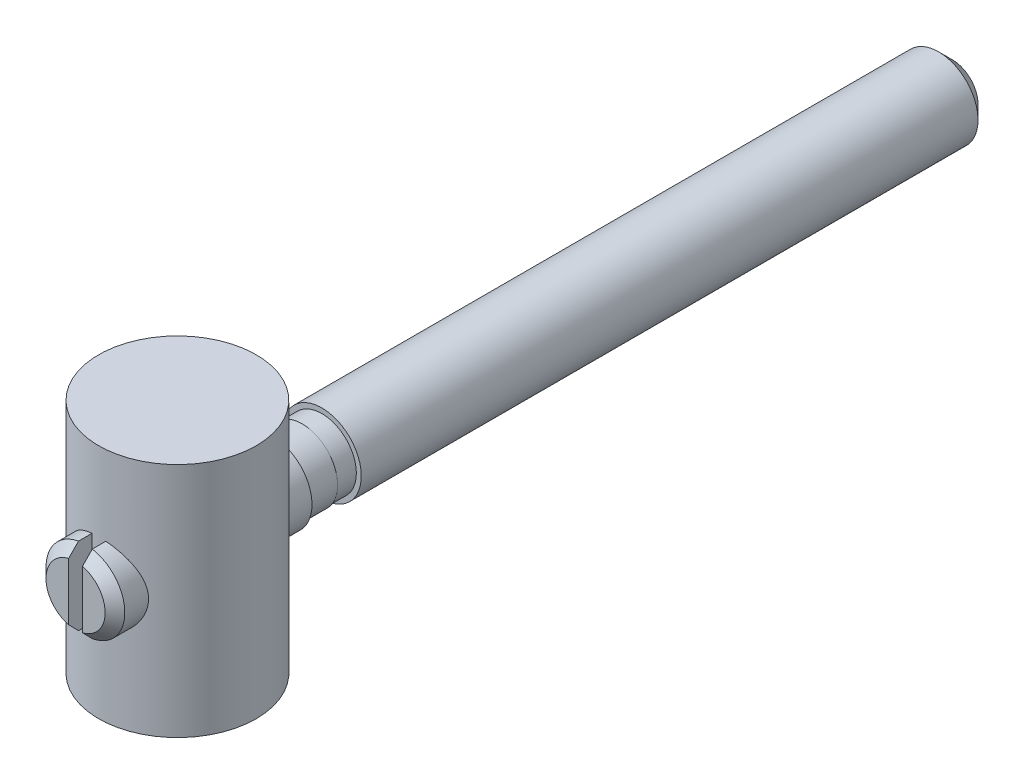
ISO-10303-21;
HEADER;
FILE_DESCRIPTION(('STEP AP214'),'2;1');
FILE_NAME('part.step','',(''),(''),'','','');
FILE_SCHEMA(('AUTOMOTIVE_DESIGN { 1 0 10303 214 1 1 1 1 }'));
ENDSEC;
DATA;
#1=APPLICATION_CONTEXT('core data for automotive mechanical design processes');
#2=APPLICATION_PROTOCOL_DEFINITION('international standard','automotive_design',2000,#1);
#3=PRODUCT_CONTEXT('',#1,'mechanical');
#4=PRODUCT('Part','Part','',(#3));
#5=PRODUCT_RELATED_PRODUCT_CATEGORY('part','',(#4));
#6=PRODUCT_DEFINITION_FORMATION('','',#4);
#7=PRODUCT_DEFINITION_CONTEXT('part definition',#1,'design');
#8=PRODUCT_DEFINITION('design','',#6,#7);
#9=PRODUCT_DEFINITION_SHAPE('','',#8);
#10=(LENGTH_UNIT() NAMED_UNIT(*) SI_UNIT(.MILLI.,.METRE.));
#11=(NAMED_UNIT(*) PLANE_ANGLE_UNIT() SI_UNIT($,.RADIAN.));
#12=(NAMED_UNIT(*) SI_UNIT($,.STERADIAN.) SOLID_ANGLE_UNIT());
#13=UNCERTAINTY_MEASURE_WITH_UNIT(LENGTH_MEASURE(1.E-05),#10,'distance_accuracy_value','');
#14=(GEOMETRIC_REPRESENTATION_CONTEXT(3) GLOBAL_UNCERTAINTY_ASSIGNED_CONTEXT((#13)) GLOBAL_UNIT_ASSIGNED_CONTEXT((#10,
#11,#12)) REPRESENTATION_CONTEXT('',''));
#15=CARTESIAN_POINT('',(0.,0.,0.));
#16=DIRECTION('',(0.,0.,1.));
#17=DIRECTION('',(1.,0.,0.));
#18=AXIS2_PLACEMENT_3D('',#15,#16,#17);
#19=CARTESIAN_POINT('',(0.,-6.,0.));
#20=DIRECTION('',(0.,-1.,0.));
#21=DIRECTION('',(1.,0.,0.));
#22=AXIS2_PLACEMENT_3D('',#19,#20,#21);
#23=PLANE('',#22);
#24=DIRECTION('',(0.5,0.,-0.866025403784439));
#25=VECTOR('',#24,1.);
#26=CARTESIAN_POINT('',(0.86602540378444,-6.,0.));
#27=LINE('',#26,#25);
#28=CARTESIAN_POINT('',(0.433012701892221,-6.,0.75));
#29=VERTEX_POINT('',#28);
#30=CARTESIAN_POINT('',(0.86602540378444,-6.,0.));
#31=VERTEX_POINT('',#30);
#32=EDGE_CURVE('E94',#29,#31,#27,.T.);
#33=ORIENTED_EDGE('',*,*,#32,.F.);
#34=DIRECTION('',(1.,0.,0.));
#35=VECTOR('',#34,1.);
#36=CARTESIAN_POINT('',(0.43301270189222,-6.,0.75));
#37=LINE('',#36,#35);
#38=CARTESIAN_POINT('',(-0.433012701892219,-6.,0.75));
#39=VERTEX_POINT('',#38);
#40=EDGE_CURVE('E92',#39,#29,#37,.T.);
#41=ORIENTED_EDGE('',*,*,#40,.F.);
#42=DIRECTION('',(0.5,0.,0.866025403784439));
#43=VECTOR('',#42,1.);
#44=CARTESIAN_POINT('',(-0.433012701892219,-6.,0.75));
#45=LINE('',#44,#43);
#46=CARTESIAN_POINT('',(-0.866025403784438,-6.,0.));
#47=VERTEX_POINT('',#46);
#48=EDGE_CURVE('E524',#47,#39,#45,.T.);
#49=ORIENTED_EDGE('',*,*,#48,.F.);
#50=DIRECTION('',(-0.5,0.,0.866025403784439));
#51=VECTOR('',#50,1.);
#52=CARTESIAN_POINT('',(-0.866025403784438,-6.,0.));
#53=LINE('',#52,#51);
#54=CARTESIAN_POINT('',(-0.433012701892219,-6.,-0.75));
#55=VERTEX_POINT('',#54);
#56=EDGE_CURVE('E574',#55,#47,#53,.T.);
#57=ORIENTED_EDGE('',*,*,#56,.F.);
#58=DIRECTION('',(-1.,0.,0.));
#59=VECTOR('',#58,1.);
#60=CARTESIAN_POINT('',(-0.433012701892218,-6.,-0.75));
#61=LINE('',#60,#59);
#62=CARTESIAN_POINT('',(0.433012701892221,-6.,-0.75));
#63=VERTEX_POINT('',#62);
#64=EDGE_CURVE('E535',#63,#55,#61,.T.);
#65=ORIENTED_EDGE('',*,*,#64,.F.);
#66=DIRECTION('',(-0.5,0.,-0.866025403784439));
#67=VECTOR('',#66,1.);
#68=CARTESIAN_POINT('',(0.433012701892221,-6.,-0.75));
#69=LINE('',#68,#67);
#70=EDGE_CURVE('E522',#31,#63,#69,.T.);
#71=ORIENTED_EDGE('',*,*,#70,.F.);
#72=EDGE_LOOP('',(#33,#41,#49,#57,#65,#71));
#73=FACE_BOUND('',#72,.T.);
#74=ADVANCED_FACE('F14',(#73),#23,.T.);
#75=CARTESIAN_POINT('',(0.433012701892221,-5.8,-0.75));
#76=DIRECTION('',(0.866025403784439,0.,-0.5));
#77=DIRECTION('',(-0.5,0.,-0.866025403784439));
#78=AXIS2_PLACEMENT_3D('',#75,#76,#77);
#79=PLANE('',#78);
#80=DIRECTION('',(0.,1.,0.));
#81=VECTOR('',#80,1.);
#82=CARTESIAN_POINT('',(0.86602540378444,-5.8,0.));
#83=LINE('',#82,#81);
#84=CARTESIAN_POINT('',(0.86602540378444,-7.,0.));
#85=VERTEX_POINT('',#84);
#86=EDGE_CURVE('E80',#31,#85,#83,.F.);
#87=ORIENTED_EDGE('',*,*,#86,.F.);
#88=ORIENTED_EDGE('',*,*,#70,.T.);
#89=DIRECTION('',(0.,1.,0.));
#90=VECTOR('',#89,1.);
#91=CARTESIAN_POINT('',(0.433012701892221,-5.8,-0.75));
#92=LINE('',#91,#90);
#93=CARTESIAN_POINT('',(0.433012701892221,-7.,-0.75));
#94=VERTEX_POINT('',#93);
#95=EDGE_CURVE('E107',#94,#63,#92,.T.);
#96=ORIENTED_EDGE('',*,*,#95,.F.);
#97=DIRECTION('',(0.5,0.,0.866025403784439));
#98=VECTOR('',#97,1.);
#99=CARTESIAN_POINT('',(0.43301270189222,-7.,-0.75));
#100=LINE('',#99,#98);
#101=EDGE_CURVE('E130',#94,#85,#100,.T.);
#102=ORIENTED_EDGE('',*,*,#101,.T.);
#103=EDGE_LOOP('',(#87,#88,#96,#102));
#104=FACE_BOUND('',#103,.T.);
#105=ADVANCED_FACE('F165',(#104),#79,.F.);
#106=CARTESIAN_POINT('',(0.86602540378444,-5.8,0.));
#107=DIRECTION('',(0.866025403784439,0.,0.5));
#108=DIRECTION('',(0.5,0.,-0.866025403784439));
#109=AXIS2_PLACEMENT_3D('',#106,#107,#108);
#110=PLANE('',#109);
#111=DIRECTION('',(0.,1.,0.));
#112=VECTOR('',#111,1.);
#113=CARTESIAN_POINT('',(0.43301270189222,-5.8,0.75));
#114=LINE('',#113,#112);
#115=CARTESIAN_POINT('',(0.43301270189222,-7.,0.75));
#116=VERTEX_POINT('',#115);
#117=EDGE_CURVE('E78',#116,#29,#114,.T.);
#118=ORIENTED_EDGE('',*,*,#117,.T.);
#119=ORIENTED_EDGE('',*,*,#32,.T.);
#120=ORIENTED_EDGE('',*,*,#86,.T.);
#121=DIRECTION('',(-0.5,0.,0.866025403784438));
#122=VECTOR('',#121,1.);
#123=CARTESIAN_POINT('',(0.86602540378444,-7.,0.));
#124=LINE('',#123,#122);
#125=EDGE_CURVE('E75',#85,#116,#124,.T.);
#126=ORIENTED_EDGE('',*,*,#125,.T.);
#127=EDGE_LOOP('',(#118,#119,#120,#126));
#128=FACE_BOUND('',#127,.T.);
#129=ADVANCED_FACE('F16',(#128),#110,.F.);
#130=CARTESIAN_POINT('',(0.43301270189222,-5.8,0.75));
#131=DIRECTION('',(0.,0.,1.));
#132=DIRECTION('',(1.,0.,0.));
#133=AXIS2_PLACEMENT_3D('',#130,#131,#132);
#134=PLANE('',#133);
#135=DIRECTION('',(0.,1.,0.));
#136=VECTOR('',#135,1.);
#137=CARTESIAN_POINT('',(-0.433012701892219,-5.8,0.75));
#138=LINE('',#137,#136);
#139=CARTESIAN_POINT('',(-0.433012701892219,-7.,0.75));
#140=VERTEX_POINT('',#139);
#141=EDGE_CURVE('E93',#140,#39,#138,.T.);
#142=ORIENTED_EDGE('',*,*,#141,.T.);
#143=ORIENTED_EDGE('',*,*,#40,.T.);
#144=ORIENTED_EDGE('',*,*,#117,.F.);
#145=DIRECTION('',(-1.,0.,0.));
#146=VECTOR('',#145,1.);
#147=CARTESIAN_POINT('',(0.,-7.,0.75));
#148=LINE('',#147,#146);
#149=EDGE_CURVE('E85',#116,#140,#148,.T.);
#150=ORIENTED_EDGE('',*,*,#149,.T.);
#151=EDGE_LOOP('',(#142,#143,#144,#150));
#152=FACE_BOUND('',#151,.T.);
#153=ADVANCED_FACE('F90',(#152),#134,.F.);
#154=CARTESIAN_POINT('',(-0.433012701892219,-5.8,0.75));
#155=DIRECTION('',(-0.866025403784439,0.,0.5));
#156=DIRECTION('',(0.5,0.,0.866025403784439));
#157=AXIS2_PLACEMENT_3D('',#154,#155,#156);
#158=PLANE('',#157);
#159=DIRECTION('',(0.,1.,0.));
#160=VECTOR('',#159,1.);
#161=CARTESIAN_POINT('',(-0.866025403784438,-5.8,0.));
#162=LINE('',#161,#160);
#163=CARTESIAN_POINT('',(-0.866025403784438,-7.,0.));
#164=VERTEX_POINT('',#163);
#165=EDGE_CURVE('E113',#164,#47,#162,.T.);
#166=ORIENTED_EDGE('',*,*,#165,.T.);
#167=ORIENTED_EDGE('',*,*,#48,.T.);
#168=ORIENTED_EDGE('',*,*,#141,.F.);
#169=DIRECTION('',(-0.5,0.,-0.866025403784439));
#170=VECTOR('',#169,1.);
#171=CARTESIAN_POINT('',(-0.43301270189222,-7.,0.75));
#172=LINE('',#171,#170);
#173=EDGE_CURVE('E100',#140,#164,#172,.T.);
#174=ORIENTED_EDGE('',*,*,#173,.T.);
#175=EDGE_LOOP('',(#166,#167,#168,#174));
#176=FACE_BOUND('',#175,.T.);
#177=ADVANCED_FACE('F175',(#176),#158,.F.);
#178=CARTESIAN_POINT('',(-0.866025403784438,-5.8,0.));
#179=DIRECTION('',(-0.866025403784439,0.,-0.5));
#180=DIRECTION('',(-0.5,0.,0.866025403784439));
#181=AXIS2_PLACEMENT_3D('',#178,#179,#180);
#182=PLANE('',#181);
#183=DIRECTION('',(0.,1.,0.));
#184=VECTOR('',#183,1.);
#185=CARTESIAN_POINT('',(-0.433012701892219,-5.8,-0.75));
#186=LINE('',#185,#184);
#187=CARTESIAN_POINT('',(-0.433012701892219,-7.,-0.75));
#188=VERTEX_POINT('',#187);
#189=EDGE_CURVE('E110',#188,#55,#186,.T.);
#190=ORIENTED_EDGE('',*,*,#189,.T.);
#191=ORIENTED_EDGE('',*,*,#56,.T.);
#192=ORIENTED_EDGE('',*,*,#165,.F.);
#193=DIRECTION('',(0.5,0.,-0.866025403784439));
#194=VECTOR('',#193,1.);
#195=CARTESIAN_POINT('',(-0.866025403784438,-7.,0.));
#196=LINE('',#195,#194);
#197=EDGE_CURVE('E102',#164,#188,#196,.T.);
#198=ORIENTED_EDGE('',*,*,#197,.T.);
#199=EDGE_LOOP('',(#190,#191,#192,#198));
#200=FACE_BOUND('',#199,.T.);
#201=ADVANCED_FACE('F171',(#200),#182,.F.);
#202=CARTESIAN_POINT('',(-0.433012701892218,-5.8,-0.75));
#203=DIRECTION('',(0.,0.,-1.));
#204=DIRECTION('',(-1.,0.,0.));
#205=AXIS2_PLACEMENT_3D('',#202,#203,#204);
#206=PLANE('',#205);
#207=ORIENTED_EDGE('',*,*,#95,.T.);
#208=ORIENTED_EDGE('',*,*,#64,.T.);
#209=ORIENTED_EDGE('',*,*,#189,.F.);
#210=DIRECTION('',(-1.,0.,0.));
#211=VECTOR('',#210,1.);
#212=CARTESIAN_POINT('',(0.,-7.,-0.75));
#213=LINE('',#212,#211);
#214=EDGE_CURVE('E529',#188,#94,#213,.F.);
#215=ORIENTED_EDGE('',*,*,#214,.T.);
#216=EDGE_LOOP('',(#207,#208,#209,#215));
#217=FACE_BOUND('',#216,.T.);
#218=ADVANCED_FACE('F163',(#217),#206,.F.);
#219=CARTESIAN_POINT('',(0.,-7.,0.));
#220=DIRECTION('',(0.,1.,0.));
#221=DIRECTION('',(-1.,0.,0.));
#222=AXIS2_PLACEMENT_3D('',#219,#220,#221);
#223=PLANE('',#222);
#224=CARTESIAN_POINT('',(0.,-7.,0.));
#225=DIRECTION('',(0.,1.,0.));
#226=DIRECTION('',(-1.,0.,0.));
#227=AXIS2_PLACEMENT_3D('',#224,#225,#226);
#228=CIRCLE('',#227,1.5);
#229=CARTESIAN_POINT('',(-1.5,-7.,0.));
#230=VERTEX_POINT('',#229);
#231=EDGE_CURVE('E127',#230,#230,#228,.T.);
#232=ORIENTED_EDGE('',*,*,#231,.F.);
#233=EDGE_LOOP('',(#232));
#234=FACE_BOUND('',#233,.T.);
#235=ORIENTED_EDGE('',*,*,#214,.F.);
#236=ORIENTED_EDGE('',*,*,#197,.F.);
#237=ORIENTED_EDGE('',*,*,#173,.F.);
#238=ORIENTED_EDGE('',*,*,#149,.F.);
#239=ORIENTED_EDGE('',*,*,#125,.F.);
#240=ORIENTED_EDGE('',*,*,#101,.F.);
#241=EDGE_LOOP('',(#235,#236,#237,#238,#239,#240));
#242=FACE_BOUND('',#241,.T.);
#243=ADVANCED_FACE('F98',(#234,#242),#223,.F.);
#244=CARTESIAN_POINT('',(0.,-4.,0.));
#245=DIRECTION('',(0.,1.,0.));
#246=DIRECTION('',(-1.,0.,0.));
#247=AXIS2_PLACEMENT_3D('',#244,#245,#246);
#248=CYLINDRICAL_SURFACE('',#247,1.5);
#249=ORIENTED_EDGE('',*,*,#231,.T.);
#250=EDGE_LOOP('',(#249));
#251=FACE_BOUND('',#250,.T.);
#252=CARTESIAN_POINT('',(0.,-6.,0.));
#253=DIRECTION('',(0.,1.,0.));
#254=DIRECTION('',(-1.,0.,0.));
#255=AXIS2_PLACEMENT_3D('',#252,#253,#254);
#256=CIRCLE('',#255,1.5);
#257=CARTESIAN_POINT('',(-1.5,-6.,0.));
#258=VERTEX_POINT('',#257);
#259=EDGE_CURVE('E124',#258,#258,#256,.F.);
#260=ORIENTED_EDGE('',*,*,#259,.T.);
#261=EDGE_LOOP('',(#260));
#262=FACE_BOUND('',#261,.T.);
#263=ADVANCED_FACE('F156',(#251,#262),#248,.T.);
#264=CARTESIAN_POINT('',(0.,6.,0.));
#265=DIRECTION('',(0.,1.,0.));
#266=DIRECTION('',(-1.,0.,0.));
#267=AXIS2_PLACEMENT_3D('',#264,#265,#266);
#268=PLANE('',#267);
#269=CARTESIAN_POINT('',(0.,6.,0.));
#270=DIRECTION('',(0.,-1.,0.));
#271=DIRECTION('',(1.,0.,0.));
#272=AXIS2_PLACEMENT_3D('',#269,#270,#271);
#273=CIRCLE('',#272,4.);
#274=CARTESIAN_POINT('',(4.,6.,0.));
#275=VERTEX_POINT('',#274);
#276=EDGE_CURVE('E121',#275,#275,#273,.T.);
#277=ORIENTED_EDGE('',*,*,#276,.F.);
#278=EDGE_LOOP('',(#277));
#279=FACE_BOUND('',#278,.T.);
#280=ADVANCED_FACE('F152',(#279),#268,.T.);
#281=CARTESIAN_POINT('',(0.,-6.,0.));
#282=DIRECTION('',(0.,1.,0.));
#283=DIRECTION('',(-1.,0.,0.));
#284=AXIS2_PLACEMENT_3D('',#281,#282,#283);
#285=PLANE('',#284);
#286=ORIENTED_EDGE('',*,*,#259,.F.);
#287=EDGE_LOOP('',(#286));
#288=FACE_BOUND('',#287,.T.);
#289=CARTESIAN_POINT('',(0.,-6.,0.));
#290=DIRECTION('',(0.,-1.,0.));
#291=DIRECTION('',(1.,0.,0.));
#292=AXIS2_PLACEMENT_3D('',#289,#290,#291);
#293=CIRCLE('',#292,4.);
#294=CARTESIAN_POINT('',(4.,-6.,0.));
#295=VERTEX_POINT('',#294);
#296=EDGE_CURVE('E117',#295,#295,#293,.F.);
#297=ORIENTED_EDGE('',*,*,#296,.F.);
#298=EDGE_LOOP('',(#297));
#299=FACE_BOUND('',#298,.T.);
#300=ADVANCED_FACE('F146',(#288,#299),#285,.F.);
#301=CARTESIAN_POINT('',(0.,6.,0.));
#302=DIRECTION('',(0.,-1.,0.));
#303=DIRECTION('',(1.,0.,0.));
#304=AXIS2_PLACEMENT_3D('',#301,#302,#303);
#305=CYLINDRICAL_SURFACE('',#304,4.);
#306=CARTESIAN_POINT('',(0.,-2.,4.));
#307=CARTESIAN_POINT('',(0.105143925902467,-1.99999339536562,3.99999426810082));
#308=CARTESIAN_POINT('',(0.210413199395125,-1.99165985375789,3.99580982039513));
#309=CARTESIAN_POINT('',(0.417840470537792,-1.95869423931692,3.97948312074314));
#310=CARTESIAN_POINT('',(0.519992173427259,-1.93403121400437,3.96732575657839));
#311=CARTESIAN_POINT('',(0.717867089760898,-1.86961238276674,3.9363255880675));
#312=CARTESIAN_POINT('',(0.813613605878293,-1.82991523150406,3.91750878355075));
#313=CARTESIAN_POINT('',(0.996945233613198,-1.73685875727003,3.87491553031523));
#314=CARTESIAN_POINT('',(1.08453098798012,-1.68350051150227,3.8511394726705));
#315=CARTESIAN_POINT('',(1.25501563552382,-1.56096550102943,3.79912516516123));
#316=CARTESIAN_POINT('',(1.33731042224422,-1.49102704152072,3.77070398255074));
#317=CARTESIAN_POINT('',(1.48955888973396,-1.33895704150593,3.71319940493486));
#318=CARTESIAN_POINT('',(1.55950316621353,-1.25681629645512,3.68411552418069));
#319=CARTESIAN_POINT('',(1.69050400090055,-1.07503330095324,3.62597902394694));
#320=CARTESIAN_POINT('',(1.75045067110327,-0.974527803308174,3.59710373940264));
#321=CARTESIAN_POINT('',(1.85233645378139,-0.76326532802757,3.54571957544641));
#322=CARTESIAN_POINT('',(1.89428842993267,-0.652515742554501,3.52320615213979));
#323=CARTESIAN_POINT('',(1.95626488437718,-0.430669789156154,3.48915734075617));
#324=CARTESIAN_POINT('',(1.97745171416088,-0.319991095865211,3.47704543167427));
#325=CARTESIAN_POINT('',(2.00085398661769,-0.0960423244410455,3.46363779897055));
#326=CARTESIAN_POINT('',(2.00308817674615,0.0172250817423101,3.46233138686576));
#327=CARTESIAN_POINT('',(1.98937457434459,0.228572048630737,3.47021860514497));
#328=CARTESIAN_POINT('',(1.97556911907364,0.326848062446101,3.47817527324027));
#329=CARTESIAN_POINT('',(1.93387969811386,0.519443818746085,3.50152457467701));
#330=CARTESIAN_POINT('',(1.9059912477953,0.613762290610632,3.51691957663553));
#331=CARTESIAN_POINT('',(1.83641956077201,0.798458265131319,3.55374952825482));
#332=CARTESIAN_POINT('',(1.79443013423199,0.888692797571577,3.57531681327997));
#333=CARTESIAN_POINT('',(1.698083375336,1.06126858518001,3.62206808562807));
#334=CARTESIAN_POINT('',(1.64372048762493,1.14360627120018,3.64725369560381));
#335=CARTESIAN_POINT('',(1.51613210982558,1.30904250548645,3.70226315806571));
#336=CARTESIAN_POINT('',(1.44138891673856,1.39091374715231,3.73227020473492));
#337=CARTESIAN_POINT('',(1.27911115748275,1.5414708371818,3.79095246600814));
#338=CARTESIAN_POINT('',(1.19157051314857,1.61015038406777,3.81962703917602));
#339=CARTESIAN_POINT('',(1.0010330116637,1.73537132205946,3.87403974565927));
#340=CARTESIAN_POINT('',(0.897507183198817,1.79120094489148,3.89957968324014));
#341=CARTESIAN_POINT('',(0.680932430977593,1.88419405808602,3.94315762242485));
#342=CARTESIAN_POINT('',(0.567891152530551,1.92137237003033,3.96120157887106));
#343=CARTESIAN_POINT('',(0.345532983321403,1.97295080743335,3.98648667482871));
#344=CARTESIAN_POINT('',(0.236683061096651,1.98898247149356,3.9944987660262));
#345=CARTESIAN_POINT('',(0.0175591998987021,2.00292946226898,4.00146026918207));
#346=CARTESIAN_POINT('',(-0.0927140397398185,2.00085337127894,4.00041397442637));
#347=CARTESIAN_POINT('',(-0.302465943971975,1.97958662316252,3.9898238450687));
#348=CARTESIAN_POINT('',(-0.402118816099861,1.96173493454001,3.98094491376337));
#349=CARTESIAN_POINT('',(-0.596813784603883,1.91152385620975,3.9564434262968));
#350=CARTESIAN_POINT('',(-0.691855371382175,1.87916286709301,3.94082012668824));
#351=CARTESIAN_POINT('',(-0.877777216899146,1.80000306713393,3.90368502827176));
#352=CARTESIAN_POINT('',(-0.968460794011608,1.75281789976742,3.88201763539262));
#353=CARTESIAN_POINT('',(-1.14092272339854,1.64578492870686,3.83487948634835));
#354=CARTESIAN_POINT('',(-1.22269725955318,1.58593173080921,3.80940711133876));
#355=CARTESIAN_POINT('',(-1.38353537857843,1.44847914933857,3.75416442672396));
#356=CARTESIAN_POINT('',(-1.46154415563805,1.3697142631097,3.72421769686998));
#357=CARTESIAN_POINT('',(-1.60371264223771,1.20014969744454,3.6652478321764));
#358=CARTESIAN_POINT('',(-1.66786277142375,1.10934176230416,3.63622534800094));
#359=CARTESIAN_POINT('',(-1.78341582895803,0.912712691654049,3.58102384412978));
#360=CARTESIAN_POINT('',(-1.8340509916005,0.806377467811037,3.55505059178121));
#361=CARTESIAN_POINT('',(-1.91616565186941,0.584979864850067,3.51148144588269));
#362=CARTESIAN_POINT('',(-1.94766983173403,0.469928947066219,3.493874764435));
#363=CARTESIAN_POINT('',(-1.98772337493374,0.24617955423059,3.47123002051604));
#364=CARTESIAN_POINT('',(-1.9981859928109,0.137931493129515,3.4651476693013));
#365=CARTESIAN_POINT('',(-2.0013783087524,-0.0788941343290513,3.46330709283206));
#366=CARTESIAN_POINT('',(-1.99411569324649,-0.187471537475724,3.4675443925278));
#367=CARTESIAN_POINT('',(-1.96385225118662,-0.390967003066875,3.48475724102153));
#368=CARTESIAN_POINT('',(-1.94241662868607,-0.486200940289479,3.49686188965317));
#369=CARTESIAN_POINT('',(-1.88635071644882,-0.671616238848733,3.52742032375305));
#370=CARTESIAN_POINT('',(-1.85171618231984,-0.761795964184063,3.54587615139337));
#371=CARTESIAN_POINT('',(-1.76763149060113,-0.941249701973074,3.58857060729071));
#372=CARTESIAN_POINT('',(-1.7173422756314,-1.03005580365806,3.61311444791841));
#373=CARTESIAN_POINT('',(-1.60430194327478,-1.19854907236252,3.66470663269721));
#374=CARTESIAN_POINT('',(-1.54154434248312,-1.27823146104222,3.69175627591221));
#375=CARTESIAN_POINT('',(-1.39640665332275,-1.43628396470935,3.74924646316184));
#376=CARTESIAN_POINT('',(-1.31256884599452,-1.51331820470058,3.77969966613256));
#377=CARTESIAN_POINT('',(-1.13230961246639,-1.65252596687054,3.83755504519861));
#378=CARTESIAN_POINT('',(-1.03588144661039,-1.71469147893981,3.8649555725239));
#379=CARTESIAN_POINT('',(-0.83186319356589,-1.82247272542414,3.91396019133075));
#380=CARTESIAN_POINT('',(-0.72419900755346,-1.86796833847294,3.93552192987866));
#381=CARTESIAN_POINT('',(-0.501484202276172,-1.93961633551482,3.97002682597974));
#382=CARTESIAN_POINT('',(-0.386455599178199,-1.96582369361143,3.98299446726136));
#383=CARTESIAN_POINT('',(-0.22520389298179,-1.98779482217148,3.99390923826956));
#384=CARTESIAN_POINT('',(-0.180323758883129,-1.99236528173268,3.99618730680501));
#385=CARTESIAN_POINT('',(-0.0903034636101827,-1.99846933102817,3.99923393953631));
#386=CARTESIAN_POINT('',(-0.0451632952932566,-2.00000283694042,4.00000246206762));
#387=CARTESIAN_POINT('',(0.,-2.,4.));
#388=B_SPLINE_CURVE_WITH_KNOTS('',3,(#306,#307,#308,#309,#310,#311,#312,#313,#314,#315,#316,
#317,#318,#319,#320,#321,#322,#323,#324,#325,#326,#327,#328,#329,#330,#331,#332,#333,#334,#335,
#336,#337,#338,#339,#340,#341,#342,#343,#344,#345,#346,#347,#348,#349,#350,#351,#352,#353,#354,
#355,#356,#357,#358,#359,#360,#361,#362,#363,#364,#365,#366,#367,#368,#369,#370,#371,#372,#373,
#374,#375,#376,#377,#378,#379,#380,#381,#382,#383,#384,#385,#386,#387),.UNSPECIFIED.,.T.,.F.,(4,
2,2,2,2,2,2,2,2,2,2,2,2,2,2,2,2,2,2,2,2,2,2,2,2,2,2,2,2,2,2,2,2,2,2,2,2,2,2,2,4),(0.,
0.315248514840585,0.631096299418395,0.945724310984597,1.26032752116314,1.59396351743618,
1.92785247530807,2.28763452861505,2.64715895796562,2.98516024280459,3.32282714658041,
3.62011424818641,3.91749607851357,4.22180480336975,4.52625042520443,4.86929882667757,
5.21251069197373,5.57166044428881,5.93052433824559,6.25966580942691,6.58865129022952,
6.89213813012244,7.19565843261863,7.50785712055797,7.82018901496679,8.16319221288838,
8.50643177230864,8.86629364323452,9.22569023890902,9.55058615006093,9.87534119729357,
10.1691586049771,10.463070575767,10.7767291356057,11.0905512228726,11.4425048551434,
11.7946476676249,12.1492802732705,12.502898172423,12.6383056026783,12.7737167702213),.UNSPECIFIED.);
#389=CARTESIAN_POINT('',(-0.35,1.96913686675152,3.98465807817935));
#390=VERTEX_POINT('',#389);
#391=CARTESIAN_POINT('',(-0.35,-1.96913686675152,3.98465807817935));
#392=VERTEX_POINT('',#391);
#393=EDGE_CURVE('E35',#390,#392,#388,.T.);
#394=ORIENTED_EDGE('',*,*,#393,.F.);
#395=DIRECTION('',(0.,-1.,0.));
#396=VECTOR('',#395,1.);
#397=CARTESIAN_POINT('',(-0.35,6.,3.98465807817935));
#398=LINE('',#397,#396);
#399=EDGE_CURVE('E135',#392,#390,#398,.F.);
#400=ORIENTED_EDGE('',*,*,#399,.F.);
#401=EDGE_LOOP('',(#394,#400));
#402=FACE_BOUND('',#401,.T.);
#403=ORIENTED_EDGE('',*,*,#296,.T.);
#404=EDGE_LOOP('',(#403));
#405=FACE_BOUND('',#404,.T.);
#406=ORIENTED_EDGE('',*,*,#276,.T.);
#407=EDGE_LOOP('',(#406));
#408=FACE_BOUND('',#407,.T.);
#409=CARTESIAN_POINT('',(0.35,-1.96913686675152,3.98465807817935));
#410=VERTEX_POINT('',#409);
#411=CARTESIAN_POINT('',(0.35,1.96913686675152,3.98465807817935));
#412=VERTEX_POINT('',#411);
#413=EDGE_CURVE('E28',#410,#412,#388,.T.);
#414=ORIENTED_EDGE('',*,*,#413,.F.);
#415=DIRECTION('',(0.,-1.,0.));
#416=VECTOR('',#415,1.);
#417=CARTESIAN_POINT('',(0.35,6.,3.98465807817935));
#418=LINE('',#417,#416);
#419=EDGE_CURVE('E559',#412,#410,#418,.T.);
#420=ORIENTED_EDGE('',*,*,#419,.F.);
#421=EDGE_LOOP('',(#414,#420));
#422=FACE_BOUND('',#421,.T.);
#423=CARTESIAN_POINT('',(0.,-2.,-4.));
#424=CARTESIAN_POINT('',(-0.105143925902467,-1.99999339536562,-3.99999426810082));
#425=CARTESIAN_POINT('',(-0.210413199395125,-1.99165985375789,-3.99580982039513));
#426=CARTESIAN_POINT('',(-0.417840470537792,-1.95869423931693,-3.97948312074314));
#427=CARTESIAN_POINT('',(-0.51999217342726,-1.93403121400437,-3.9673257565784));
#428=CARTESIAN_POINT('',(-0.717867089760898,-1.86961238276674,-3.93632558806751));
#429=CARTESIAN_POINT('',(-0.813613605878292,-1.82991523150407,-3.91750878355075));
#430=CARTESIAN_POINT('',(-0.996945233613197,-1.73685875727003,-3.87491553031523));
#431=CARTESIAN_POINT('',(-1.08453098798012,-1.68350051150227,-3.85113947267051));
#432=CARTESIAN_POINT('',(-1.25501563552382,-1.56096550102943,-3.79912516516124));
#433=CARTESIAN_POINT('',(-1.33731042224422,-1.49102704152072,-3.77070398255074));
#434=CARTESIAN_POINT('',(-1.48955888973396,-1.33895704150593,-3.71319940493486));
#435=CARTESIAN_POINT('',(-1.55950316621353,-1.25681629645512,-3.6841155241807));
#436=CARTESIAN_POINT('',(-1.69050400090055,-1.07503330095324,-3.62597902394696));
#437=CARTESIAN_POINT('',(-1.75045067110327,-0.974527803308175,-3.59710373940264));
#438=CARTESIAN_POINT('',(-1.85233645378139,-0.763265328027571,-3.54571957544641));
#439=CARTESIAN_POINT('',(-1.89428842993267,-0.652515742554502,-3.52320615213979));
#440=CARTESIAN_POINT('',(-1.95626488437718,-0.430669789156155,-3.48915734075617));
#441=CARTESIAN_POINT('',(-1.97745171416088,-0.319991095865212,-3.47704543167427));
#442=CARTESIAN_POINT('',(-2.00085398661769,-0.0960423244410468,-3.46363779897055));
#443=CARTESIAN_POINT('',(-2.00308817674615,0.0172250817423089,-3.46233138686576));
#444=CARTESIAN_POINT('',(-1.98937457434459,0.228572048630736,-3.47021860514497));
#445=CARTESIAN_POINT('',(-1.97556911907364,0.3268480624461,-3.47817527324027));
#446=CARTESIAN_POINT('',(-1.93387969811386,0.519443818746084,-3.50152457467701));
#447=CARTESIAN_POINT('',(-1.9059912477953,0.613762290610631,-3.51691957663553));
#448=CARTESIAN_POINT('',(-1.83641956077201,0.798458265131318,-3.55374952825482));
#449=CARTESIAN_POINT('',(-1.79443013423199,0.888692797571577,-3.57531681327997));
#450=CARTESIAN_POINT('',(-1.698083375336,1.06126858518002,-3.62206808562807));
#451=CARTESIAN_POINT('',(-1.64372048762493,1.14360627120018,-3.64725369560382));
#452=CARTESIAN_POINT('',(-1.51613210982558,1.30904250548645,-3.70226315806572));
#453=CARTESIAN_POINT('',(-1.44138891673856,1.39091374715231,-3.73227020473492));
#454=CARTESIAN_POINT('',(-1.27911115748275,1.5414708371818,-3.79095246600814));
#455=CARTESIAN_POINT('',(-1.19157051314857,1.61015038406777,-3.81962703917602));
#456=CARTESIAN_POINT('',(-1.0010330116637,1.73537132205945,-3.87403974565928));
#457=CARTESIAN_POINT('',(-0.897507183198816,1.79120094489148,-3.89957968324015));
#458=CARTESIAN_POINT('',(-0.680932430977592,1.88419405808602,-3.94315762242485));
#459=CARTESIAN_POINT('',(-0.567891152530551,1.92137237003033,-3.96120157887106));
#460=CARTESIAN_POINT('',(-0.345532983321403,1.97295080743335,-3.98648667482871));
#461=CARTESIAN_POINT('',(-0.236683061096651,1.98898247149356,-3.9944987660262));
#462=CARTESIAN_POINT('',(-0.0175591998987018,2.00292946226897,-4.00146026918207));
#463=CARTESIAN_POINT('',(0.0927140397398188,2.00085337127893,-4.00041397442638));
#464=CARTESIAN_POINT('',(0.302465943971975,1.97958662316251,-3.9898238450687));
#465=CARTESIAN_POINT('',(0.402118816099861,1.96173493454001,-3.98094491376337));
#466=CARTESIAN_POINT('',(0.596813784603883,1.91152385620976,-3.95644342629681));
#467=CARTESIAN_POINT('',(0.691855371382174,1.87916286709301,-3.94082012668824));
#468=CARTESIAN_POINT('',(0.877777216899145,1.80000306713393,-3.90368502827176));
#469=CARTESIAN_POINT('',(0.968460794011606,1.75281789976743,-3.88201763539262));
#470=CARTESIAN_POINT('',(1.14092272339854,1.64578492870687,-3.83487948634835));
#471=CARTESIAN_POINT('',(1.22269725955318,1.58593173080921,-3.80940711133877));
#472=CARTESIAN_POINT('',(1.38353537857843,1.44847914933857,-3.75416442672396));
#473=CARTESIAN_POINT('',(1.46154415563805,1.36971426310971,-3.72421769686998));
#474=CARTESIAN_POINT('',(1.60371264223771,1.20014969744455,-3.6652478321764));
#475=CARTESIAN_POINT('',(1.66786277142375,1.10934176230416,-3.63622534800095));
#476=CARTESIAN_POINT('',(1.78341582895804,0.912712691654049,-3.58102384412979));
#477=CARTESIAN_POINT('',(1.8340509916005,0.806377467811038,-3.55505059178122));
#478=CARTESIAN_POINT('',(1.91616565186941,0.584979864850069,-3.51148144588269));
#479=CARTESIAN_POINT('',(1.94766983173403,0.46992894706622,-3.493874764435));
#480=CARTESIAN_POINT('',(1.98772337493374,0.24617955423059,-3.47123002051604));
#481=CARTESIAN_POINT('',(1.9981859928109,0.137931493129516,-3.4651476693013));
#482=CARTESIAN_POINT('',(2.00137830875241,-0.0788941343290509,-3.46330709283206));
#483=CARTESIAN_POINT('',(1.99411569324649,-0.187471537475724,-3.4675443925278));
#484=CARTESIAN_POINT('',(1.96385225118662,-0.390967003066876,-3.48475724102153));
#485=CARTESIAN_POINT('',(1.94241662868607,-0.486200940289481,-3.49686188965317));
#486=CARTESIAN_POINT('',(1.88635071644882,-0.671616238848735,-3.52742032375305));
#487=CARTESIAN_POINT('',(1.85171618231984,-0.761795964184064,-3.54587615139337));
#488=CARTESIAN_POINT('',(1.76763149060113,-0.941249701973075,-3.58857060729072));
#489=CARTESIAN_POINT('',(1.7173422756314,-1.03005580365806,-3.61311444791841));
#490=CARTESIAN_POINT('',(1.60430194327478,-1.19854907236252,-3.66470663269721));
#491=CARTESIAN_POINT('',(1.54154434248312,-1.27823146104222,-3.69175627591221));
#492=CARTESIAN_POINT('',(1.39640665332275,-1.43628396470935,-3.74924646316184));
#493=CARTESIAN_POINT('',(1.31256884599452,-1.51331820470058,-3.77969966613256));
#494=CARTESIAN_POINT('',(1.13230961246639,-1.65252596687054,-3.83755504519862));
#495=CARTESIAN_POINT('',(1.03588144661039,-1.71469147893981,-3.86495557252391));
#496=CARTESIAN_POINT('',(0.83186319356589,-1.82247272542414,-3.91396019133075));
#497=CARTESIAN_POINT('',(0.72419900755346,-1.86796833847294,-3.93552192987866));
#498=CARTESIAN_POINT('',(0.501484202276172,-1.93961633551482,-3.97002682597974));
#499=CARTESIAN_POINT('',(0.386455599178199,-1.96582369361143,-3.98299446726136));
#500=CARTESIAN_POINT('',(0.22520389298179,-1.98779482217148,-3.99390923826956));
#501=CARTESIAN_POINT('',(0.18032375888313,-1.99236528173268,-3.99618730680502));
#502=CARTESIAN_POINT('',(0.0903034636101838,-1.99846933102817,-3.99923393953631));
#503=CARTESIAN_POINT('',(0.0451632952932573,-2.00000283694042,-4.00000246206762));
#504=CARTESIAN_POINT('',(0.,-2.,-4.));
#505=B_SPLINE_CURVE_WITH_KNOTS('',3,(#423,#424,#425,#426,#427,#428,#429,#430,#431,#432,#433,
#434,#435,#436,#437,#438,#439,#440,#441,#442,#443,#444,#445,#446,#447,#448,#449,#450,#451,#452,
#453,#454,#455,#456,#457,#458,#459,#460,#461,#462,#463,#464,#465,#466,#467,#468,#469,#470,#471,
#472,#473,#474,#475,#476,#477,#478,#479,#480,#481,#482,#483,#484,#485,#486,#487,#488,#489,#490,
#491,#492,#493,#494,#495,#496,#497,#498,#499,#500,#501,#502,#503,#504),.UNSPECIFIED.,.T.,.F.,(4,
2,2,2,2,2,2,2,2,2,2,2,2,2,2,2,2,2,2,2,2,2,2,2,2,2,2,2,2,2,2,2,2,2,2,2,2,2,2,2,4),(0.,
0.315248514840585,0.631096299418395,0.945724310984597,1.26032752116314,1.59396351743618,
1.92785247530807,2.28763452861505,2.64715895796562,2.98516024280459,3.32282714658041,
3.62011424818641,3.91749607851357,4.22180480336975,4.52625042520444,4.86929882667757,
5.21251069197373,5.57166044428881,5.93052433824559,6.25966580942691,6.58865129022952,
6.89213813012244,7.19565843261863,7.50785712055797,7.82018901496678,8.16319221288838,
8.50643177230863,8.86629364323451,9.22569023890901,9.55058615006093,9.87534119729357,
10.1691586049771,10.463070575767,10.7767291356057,11.0905512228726,11.4425048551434,
11.7946476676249,12.1492802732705,12.502898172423,12.6383056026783,12.7737167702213),.UNSPECIFIED.);
#506=CARTESIAN_POINT('',(0.,-2.,-4.));
#507=VERTEX_POINT('',#506);
#508=EDGE_CURVE('E9',#507,#507,#505,.T.);
#509=ORIENTED_EDGE('',*,*,#508,.F.);
#510=EDGE_LOOP('',(#509));
#511=FACE_BOUND('',#510,.T.);
#512=ADVANCED_FACE('F140',(#402,#405,#408,#422,#511),#305,.T.);
#513=CARTESIAN_POINT('',(0.,0.,5.17012492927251));
#514=DIRECTION('',(0.,0.,-1.));
#515=DIRECTION('',(0.,1.,0.));
#516=AXIS2_PLACEMENT_3D('',#513,#514,#515);
#517=PLANE('',#516);
#518=CARTESIAN_POINT('',(0.,0.,5.17012492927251));
#519=DIRECTION('',(0.,0.,-1.));
#520=DIRECTION('',(0.,1.,0.));
#521=AXIS2_PLACEMENT_3D('',#518,#519,#520);
#522=CIRCLE('',#521,1.5);
#523=CARTESIAN_POINT('',(0.35,-1.45859521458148,5.17012492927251));
#524=VERTEX_POINT('',#523);
#525=CARTESIAN_POINT('',(0.35,1.45859521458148,5.17012492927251));
#526=VERTEX_POINT('',#525);
#527=EDGE_CURVE('E218',#524,#526,#522,.F.);
#528=ORIENTED_EDGE('',*,*,#527,.T.);
#529=DIRECTION('',(0.,1.,0.));
#530=VECTOR('',#529,1.);
#531=CARTESIAN_POINT('',(0.35,1.96913686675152,5.17012492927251));
#532=LINE('',#531,#530);
#533=EDGE_CURVE('E120',#524,#526,#532,.T.);
#534=ORIENTED_EDGE('',*,*,#533,.F.);
#535=EDGE_LOOP('',(#528,#534));
#536=FACE_BOUND('',#535,.T.);
#537=ADVANCED_FACE('F145',(#536),#517,.F.);
#538=CARTESIAN_POINT('',(0.,0.,5.17012492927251));
#539=DIRECTION('',(0.,0.,-1.));
#540=DIRECTION('',(0.,1.,0.));
#541=AXIS2_PLACEMENT_3D('',#538,#539,#540);
#542=CONICAL_SURFACE('',#541,1.5,0.785398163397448);
#543=CARTESIAN_POINT('',(0.35,-4.35126885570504,2.30480241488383));
#544=CARTESIAN_POINT('',(0.350000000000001,-4.19641291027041,2.45915521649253));
#545=CARTESIAN_POINT('',(0.350000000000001,-4.04153476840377,2.61348578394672));
#546=CARTESIAN_POINT('',(0.350000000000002,-3.73169612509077,2.9220783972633));
#547=CARTESIAN_POINT('',(0.350000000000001,-3.57673562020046,3.07634043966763));
#548=CARTESIAN_POINT('',(0.350000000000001,-3.26653656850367,3.38492880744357));
#549=CARTESIAN_POINT('',(0.350000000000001,-3.11129790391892,3.53925501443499));
#550=CARTESIAN_POINT('',(0.350000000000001,-2.80066386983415,3.84773590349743));
#551=CARTESIAN_POINT('',(0.350000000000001,-2.64526850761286,4.00189059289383));
#552=CARTESIAN_POINT('',(0.350000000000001,-2.34228144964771,4.30192668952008));
#553=CARTESIAN_POINT('',(0.350000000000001,-2.19470355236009,4.4478220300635));
#554=CARTESIAN_POINT('',(0.350000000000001,-1.89910586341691,4.73920311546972));
#555=CARTESIAN_POINT('',(0.350000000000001,-1.75108601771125,4.88468880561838));
#556=CARTESIAN_POINT('',(0.350000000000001,-1.52844687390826,5.10219422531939));
#557=CARTESIAN_POINT('',(0.350000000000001,-1.45415744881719,5.17455120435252));
#558=CARTESIAN_POINT('',(0.350000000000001,-1.30522725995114,5.31891029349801));
#559=CARTESIAN_POINT('',(0.350000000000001,-1.23058647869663,5.39091238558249));
#560=CARTESIAN_POINT('',(0.350000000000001,-1.08076094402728,5.53431637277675));
#561=CARTESIAN_POINT('',(0.350000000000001,-1.00557632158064,5.60571840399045));
#562=CARTESIAN_POINT('',(0.350000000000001,-0.892022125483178,5.71198570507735));
#563=CARTESIAN_POINT('',(0.350000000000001,-0.854042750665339,5.7472674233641));
#564=CARTESIAN_POINT('',(0.35,-0.777709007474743,5.81742229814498));
#565=CARTESIAN_POINT('',(0.35,-0.739354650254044,5.85229546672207));
#566=CARTESIAN_POINT('',(0.35,-0.679196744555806,5.90611126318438));
#567=CARTESIAN_POINT('',(0.350000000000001,-0.657585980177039,5.92526919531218));
#568=CARTESIAN_POINT('',(0.350000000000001,-0.614138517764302,5.96333222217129));
#569=CARTESIAN_POINT('',(0.350000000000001,-0.592301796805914,5.98223729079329));
#570=CARTESIAN_POINT('',(0.350000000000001,-0.548146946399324,6.01987082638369));
#571=CARTESIAN_POINT('',(0.350000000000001,-0.525826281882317,6.03859632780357));
#572=CARTESIAN_POINT('',(0.35,-0.480797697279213,6.07556550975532));
#573=CARTESIAN_POINT('',(0.35,-0.458089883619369,6.09380931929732));
#574=CARTESIAN_POINT('',(0.35,-0.411906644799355,6.12979649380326));
#575=CARTESIAN_POINT('',(0.35,-0.388425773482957,6.14753291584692));
#576=CARTESIAN_POINT('',(0.350000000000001,-0.340709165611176,6.18195596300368));
#577=CARTESIAN_POINT('',(0.350000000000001,-0.316473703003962,6.19864296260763));
#578=CARTESIAN_POINT('',(0.350000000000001,-0.267118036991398,6.23024564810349));
#579=CARTESIAN_POINT('',(0.350000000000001,-0.242006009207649,6.24517389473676));
#580=CARTESIAN_POINT('',(0.35,-0.190376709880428,6.27230332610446));
#581=CARTESIAN_POINT('',(0.35,-0.163863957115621,6.2845126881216));
#582=CARTESIAN_POINT('',(0.35,-0.115662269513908,6.3020158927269));
#583=CARTESIAN_POINT('',(0.35,-0.0943343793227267,6.30826506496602));
#584=CARTESIAN_POINT('',(0.35,-0.0509670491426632,6.31706349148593));
#585=CARTESIAN_POINT('',(0.35,-0.0289307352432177,6.31962719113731));
#586=CARTESIAN_POINT('',(0.35,0.0153473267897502,6.32049089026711));
#587=CARTESIAN_POINT('',(0.35,0.0375895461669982,6.31876844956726));
#588=CARTESIAN_POINT('',(0.35,0.0814521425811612,6.31143148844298));
#589=CARTESIAN_POINT('',(0.35,0.103070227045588,6.30580415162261));
#590=CARTESIAN_POINT('',(0.35,0.146000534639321,6.29145468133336));
#591=CARTESIAN_POINT('',(0.35,0.167279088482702,6.28263649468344));
#592=CARTESIAN_POINT('',(0.350000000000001,0.208879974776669,6.26294636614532));
#593=CARTESIAN_POINT('',(0.35,0.229200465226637,6.25207065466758));
#594=CARTESIAN_POINT('',(0.35,0.269207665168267,6.22887096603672));
#595=CARTESIAN_POINT('',(0.35,0.288887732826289,6.21653574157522));
#596=CARTESIAN_POINT('',(0.35,0.327605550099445,6.19094192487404));
#597=CARTESIAN_POINT('',(0.35,0.346643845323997,6.17768414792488));
#598=CARTESIAN_POINT('',(0.35,0.406445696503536,6.13451144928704));
#599=CARTESIAN_POINT('',(0.35,0.44633856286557,6.1033996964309));
#600=CARTESIAN_POINT('',(0.350000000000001,0.52489255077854,6.03964930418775));
#601=CARTESIAN_POINT('',(0.35,0.563552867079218,6.00700969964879));
#602=CARTESIAN_POINT('',(0.35,0.640169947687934,5.9407788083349));
#603=CARTESIAN_POINT('',(0.35,0.678125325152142,5.90718591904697));
#604=CARTESIAN_POINT('',(0.35,0.753518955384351,5.83945001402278));
#605=CARTESIAN_POINT('',(0.35,0.790957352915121,5.80530715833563));
#606=CARTESIAN_POINT('',(0.35,0.902510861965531,5.70256367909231));
#607=CARTESIAN_POINT('',(0.35,0.976123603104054,5.63341855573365));
#608=CARTESIAN_POINT('',(0.35,1.12257494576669,5.49447157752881));
#609=CARTESIAN_POINT('',(0.35,1.19541427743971,5.42467048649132));
#610=CARTESIAN_POINT('',(0.35,1.39829359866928,5.22912073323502));
#611=CARTESIAN_POINT('',(0.35,1.5278832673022,5.10290515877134));
#612=CARTESIAN_POINT('',(0.35,1.7864754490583,4.84987164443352));
#613=CARTESIAN_POINT('',(0.35,1.91547795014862,4.72305369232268));
#614=CARTESIAN_POINT('',(0.35,2.17321511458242,4.4690145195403));
#615=CARTESIAN_POINT('',(0.35,2.30194960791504,4.34179312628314));
#616=CARTESIAN_POINT('',(0.35,2.55921717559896,4.08714911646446));
#617=CARTESIAN_POINT('',(0.35,2.68775025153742,3.95972650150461));
#618=CARTESIAN_POINT('',(0.35,3.07247665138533,3.57794239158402));
#619=CARTESIAN_POINT('',(0.35,3.32848011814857,3.32338958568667));
#620=CARTESIAN_POINT('',(0.35,3.71223239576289,2.94144844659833));
#621=CARTESIAN_POINT('',(0.35,3.84007220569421,2.81415144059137));
#622=CARTESIAN_POINT('',(0.35,4.09570351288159,2.55950967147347));
#623=CARTESIAN_POINT('',(0.35,4.22349501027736,2.43216490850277));
#624=CARTESIAN_POINT('',(0.35,4.35126885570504,2.30480241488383));
#625=B_SPLINE_CURVE_WITH_KNOTS('',3,(#543,#544,#545,#546,#547,#548,#549,#550,#551,#552,#553,
#554,#555,#556,#557,#558,#559,#560,#561,#562,#563,#564,#565,#566,#567,#568,#569,#570,#571,#572,
#573,#574,#575,#576,#577,#578,#579,#580,#581,#582,#583,#584,#585,#586,#587,#588,#589,#590,#591,
#592,#593,#594,#595,#596,#597,#598,#599,#600,#601,#602,#603,#604,#605,#606,#607,#608,#609,#610,
#611,#612,#613,#614,#615,#616,#617,#618,#619,#620,#621,#622,#623,#624),.UNSPECIFIED.,.F.,.F.,(4,
2,2,2,2,2,2,2,2,2,2,2,2,2,2,2,2,2,2,2,2,2,2,2,2,2,2,2,2,2,2,2,2,2,2,2,2,2,2,2,4),(0.,
0.655931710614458,1.31189343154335,1.96858248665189,2.62524232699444,3.24780305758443,
3.87044333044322,4.18155345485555,4.49267922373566,4.80373240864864,4.95924629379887,
5.11475556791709,5.20139397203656,5.28804125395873,5.37544205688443,5.46281920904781,
5.55108162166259,5.63931235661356,5.72686889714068,5.81415843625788,5.8805913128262,
5.94676308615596,6.01328203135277,6.08002033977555,6.14896231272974,6.21803183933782,
6.28767333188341,6.35725404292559,6.50893272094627,6.66070854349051,6.81275669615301,
6.96476137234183,7.2677319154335,7.57038509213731,8.11307078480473,8.65576754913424,
9.19874089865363,9.74170994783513,10.8247672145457,11.3659953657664,11.9072219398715),.UNSPECIFIED.);
#626=CARTESIAN_POINT('',(0.35,-1.96913686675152,4.67012492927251));
#627=VERTEX_POINT('',#626);
#628=EDGE_CURVE('E241',#627,#524,#625,.T.);
#629=ORIENTED_EDGE('',*,*,#628,.F.);
#630=CARTESIAN_POINT('',(0.,0.,4.67012492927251));
#631=DIRECTION('',(0.,0.,-1.));
#632=DIRECTION('',(0.,1.,0.));
#633=AXIS2_PLACEMENT_3D('',#630,#631,#632);
#634=CIRCLE('',#633,2.);
#635=CARTESIAN_POINT('',(0.35,1.96913686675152,4.67012492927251));
#636=VERTEX_POINT('',#635);
#637=EDGE_CURVE('E221',#636,#627,#634,.T.);
#638=ORIENTED_EDGE('',*,*,#637,.F.);
#639=EDGE_CURVE('E234',#526,#636,#625,.T.);
#640=ORIENTED_EDGE('',*,*,#639,.F.);
#641=ORIENTED_EDGE('',*,*,#527,.F.);
#642=EDGE_LOOP('',(#629,#638,#640,#641));
#643=FACE_BOUND('',#642,.T.);
#644=ADVANCED_FACE('F185',(#643),#542,.T.);
#645=CARTESIAN_POINT('',(0.,0.,35.4654908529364));
#646=DIRECTION('',(0.,0.,1.));
#647=DIRECTION('',(0.,-1.,0.));
#648=AXIS2_PLACEMENT_3D('',#645,#646,#647);
#649=CYLINDRICAL_SURFACE('',#648,2.);
#650=DIRECTION('',(0.,0.,1.));
#651=VECTOR('',#650,1.);
#652=CARTESIAN_POINT('',(0.35,-1.96913686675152,3.77012492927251));
#653=LINE('',#652,#651);
#654=EDGE_CURVE('E285',#410,#627,#653,.T.);
#655=ORIENTED_EDGE('',*,*,#654,.F.);
#656=ORIENTED_EDGE('',*,*,#413,.T.);
#657=DIRECTION('',(0.,0.,1.));
#658=VECTOR('',#657,1.);
#659=CARTESIAN_POINT('',(0.35,1.96913686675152,3.77012492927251));
#660=LINE('',#659,#658);
#661=EDGE_CURVE('E278',#412,#636,#660,.T.);
#662=ORIENTED_EDGE('',*,*,#661,.T.);
#663=ORIENTED_EDGE('',*,*,#637,.T.);
#664=EDGE_LOOP('',(#655,#656,#662,#663));
#665=FACE_BOUND('',#664,.T.);
#666=ADVANCED_FACE('F190',(#665),#649,.T.);
#667=CARTESIAN_POINT('',(0.35,1.96913686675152,3.77012492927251));
#668=DIRECTION('',(1.,0.,0.));
#669=DIRECTION('',(0.,1.,0.));
#670=AXIS2_PLACEMENT_3D('',#667,#668,#669);
#671=PLANE('',#670);
#672=ORIENTED_EDGE('',*,*,#661,.F.);
#673=ORIENTED_EDGE('',*,*,#419,.T.);
#674=ORIENTED_EDGE('',*,*,#654,.T.);
#675=ORIENTED_EDGE('',*,*,#628,.T.);
#676=ORIENTED_EDGE('',*,*,#533,.T.);
#677=ORIENTED_EDGE('',*,*,#639,.T.);
#678=EDGE_LOOP('',(#672,#673,#674,#675,#676,#677));
#679=FACE_BOUND('',#678,.T.);
#680=ADVANCED_FACE('F197',(#679),#671,.F.);
#681=CARTESIAN_POINT('',(-0.35,1.45859521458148,5.17012492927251));
#682=VERTEX_POINT('',#681);
#683=CARTESIAN_POINT('',(-0.35,-1.45859521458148,5.17012492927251));
#684=VERTEX_POINT('',#683);
#685=EDGE_CURVE('E209',#682,#684,#522,.F.);
#686=ORIENTED_EDGE('',*,*,#685,.T.);
#687=DIRECTION('',(0.,-1.,0.));
#688=VECTOR('',#687,1.);
#689=CARTESIAN_POINT('',(-0.35,1.96913686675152,5.17012492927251));
#690=LINE('',#689,#688);
#691=EDGE_CURVE('E212',#682,#684,#690,.T.);
#692=ORIENTED_EDGE('',*,*,#691,.F.);
#693=EDGE_LOOP('',(#686,#692));
#694=FACE_BOUND('',#693,.T.);
#695=ADVANCED_FACE('F147',(#694),#517,.F.);
#696=CARTESIAN_POINT('',(-0.35,4.35126885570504,2.30480241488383));
#697=CARTESIAN_POINT('',(-0.35,4.1964129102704,2.45915521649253));
#698=CARTESIAN_POINT('',(-0.35,4.04153476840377,2.61348578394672));
#699=CARTESIAN_POINT('',(-0.35,3.73169612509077,2.9220783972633));
#700=CARTESIAN_POINT('',(-0.35,3.57673562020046,3.07634043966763));
#701=CARTESIAN_POINT('',(-0.35,3.26653656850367,3.38492880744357));
#702=CARTESIAN_POINT('',(-0.35,3.11129790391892,3.53925501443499));
#703=CARTESIAN_POINT('',(-0.35,2.80066386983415,3.84773590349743));
#704=CARTESIAN_POINT('',(-0.35,2.64526850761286,4.00189059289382));
#705=CARTESIAN_POINT('',(-0.35,2.34228144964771,4.30192668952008));
#706=CARTESIAN_POINT('',(-0.35,2.19470355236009,4.4478220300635));
#707=CARTESIAN_POINT('',(-0.35,1.89910586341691,4.73920311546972));
#708=CARTESIAN_POINT('',(-0.35,1.75108601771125,4.88468880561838));
#709=CARTESIAN_POINT('',(-0.35,1.52844687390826,5.10219422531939));
#710=CARTESIAN_POINT('',(-0.35,1.45415744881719,5.17455120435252));
#711=CARTESIAN_POINT('',(-0.35,1.30522725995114,5.31891029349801));
#712=CARTESIAN_POINT('',(-0.35,1.23058647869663,5.39091238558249));
#713=CARTESIAN_POINT('',(-0.35,1.08076094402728,5.53431637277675));
#714=CARTESIAN_POINT('',(-0.35,1.00557632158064,5.60571840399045));
#715=CARTESIAN_POINT('',(-0.35,0.892022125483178,5.71198570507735));
#716=CARTESIAN_POINT('',(-0.35,0.854042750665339,5.7472674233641));
#717=CARTESIAN_POINT('',(-0.35,0.777709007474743,5.81742229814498));
#718=CARTESIAN_POINT('',(-0.35,0.739354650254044,5.85229546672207));
#719=CARTESIAN_POINT('',(-0.35,0.679196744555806,5.90611126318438));
#720=CARTESIAN_POINT('',(-0.35,0.657585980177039,5.92526919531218));
#721=CARTESIAN_POINT('',(-0.35,0.614138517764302,5.96333222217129));
#722=CARTESIAN_POINT('',(-0.35,0.592301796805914,5.98223729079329));
#723=CARTESIAN_POINT('',(-0.35,0.548146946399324,6.01987082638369));
#724=CARTESIAN_POINT('',(-0.35,0.525826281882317,6.03859632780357));
#725=CARTESIAN_POINT('',(-0.35,0.480797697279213,6.07556550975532));
#726=CARTESIAN_POINT('',(-0.35,0.458089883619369,6.09380931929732));
#727=CARTESIAN_POINT('',(-0.35,0.411906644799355,6.12979649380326));
#728=CARTESIAN_POINT('',(-0.35,0.388425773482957,6.14753291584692));
#729=CARTESIAN_POINT('',(-0.35,0.340709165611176,6.18195596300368));
#730=CARTESIAN_POINT('',(-0.35,0.316473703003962,6.19864296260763));
#731=CARTESIAN_POINT('',(-0.35,0.267118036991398,6.23024564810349));
#732=CARTESIAN_POINT('',(-0.35,0.242006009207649,6.24517389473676));
#733=CARTESIAN_POINT('',(-0.35,0.190376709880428,6.27230332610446));
#734=CARTESIAN_POINT('',(-0.35,0.163863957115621,6.2845126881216));
#735=CARTESIAN_POINT('',(-0.35,0.115662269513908,6.3020158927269));
#736=CARTESIAN_POINT('',(-0.35,0.0943343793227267,6.30826506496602));
#737=CARTESIAN_POINT('',(-0.35,0.0509670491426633,6.31706349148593));
#738=CARTESIAN_POINT('',(-0.35,0.0289307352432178,6.31962719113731));
#739=CARTESIAN_POINT('',(-0.35,-0.0153473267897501,6.32049089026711));
#740=CARTESIAN_POINT('',(-0.35,-0.0375895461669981,6.31876844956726));
#741=CARTESIAN_POINT('',(-0.35,-0.0814521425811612,6.31143148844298));
#742=CARTESIAN_POINT('',(-0.35,-0.103070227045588,6.30580415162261));
#743=CARTESIAN_POINT('',(-0.35,-0.146000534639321,6.29145468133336));
#744=CARTESIAN_POINT('',(-0.35,-0.167279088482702,6.28263649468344));
#745=CARTESIAN_POINT('',(-0.35,-0.208879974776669,6.26294636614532));
#746=CARTESIAN_POINT('',(-0.35,-0.229200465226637,6.25207065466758));
#747=CARTESIAN_POINT('',(-0.35,-0.269207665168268,6.22887096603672));
#748=CARTESIAN_POINT('',(-0.35,-0.28888773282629,6.21653574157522));
#749=CARTESIAN_POINT('',(-0.35,-0.327605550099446,6.19094192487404));
#750=CARTESIAN_POINT('',(-0.35,-0.346643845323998,6.17768414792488));
#751=CARTESIAN_POINT('',(-0.35,-0.406445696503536,6.13451144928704));
#752=CARTESIAN_POINT('',(-0.35,-0.446338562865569,6.1033996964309));
#753=CARTESIAN_POINT('',(-0.35,-0.52489255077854,6.03964930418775));
#754=CARTESIAN_POINT('',(-0.35,-0.563552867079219,6.00700969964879));
#755=CARTESIAN_POINT('',(-0.35,-0.640169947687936,5.9407788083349));
#756=CARTESIAN_POINT('',(-0.35,-0.678125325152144,5.90718591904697));
#757=CARTESIAN_POINT('',(-0.35,-0.753518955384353,5.83945001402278));
#758=CARTESIAN_POINT('',(-0.35,-0.790957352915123,5.80530715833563));
#759=CARTESIAN_POINT('',(-0.35,-0.902510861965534,5.7025636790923));
#760=CARTESIAN_POINT('',(-0.35,-0.976123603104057,5.63341855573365));
#761=CARTESIAN_POINT('',(-0.35,-1.12257494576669,5.4944715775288));
#762=CARTESIAN_POINT('',(-0.35,-1.19541427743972,5.42467048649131));
#763=CARTESIAN_POINT('',(-0.35,-1.39829359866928,5.22912073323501));
#764=CARTESIAN_POINT('',(-0.35,-1.5278832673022,5.10290515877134));
#765=CARTESIAN_POINT('',(-0.35,-1.78647544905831,4.84987164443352));
#766=CARTESIAN_POINT('',(-0.35,-1.91547795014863,4.72305369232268));
#767=CARTESIAN_POINT('',(-0.35,-2.17321511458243,4.4690145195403));
#768=CARTESIAN_POINT('',(-0.35,-2.30194960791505,4.34179312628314));
#769=CARTESIAN_POINT('',(-0.35,-2.55921717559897,4.08714911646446));
#770=CARTESIAN_POINT('',(-0.35,-2.68775025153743,3.95972650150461));
#771=CARTESIAN_POINT('',(-0.35,-3.07247665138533,3.57794239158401));
#772=CARTESIAN_POINT('',(-0.35,-3.32848011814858,3.32338958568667));
#773=CARTESIAN_POINT('',(-0.35,-3.7122323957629,2.94144844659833));
#774=CARTESIAN_POINT('',(-0.35,-3.84007220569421,2.81415144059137));
#775=CARTESIAN_POINT('',(-0.35,-4.09570351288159,2.55950967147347));
#776=CARTESIAN_POINT('',(-0.35,-4.22349501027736,2.43216490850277));
#777=CARTESIAN_POINT('',(-0.35,-4.35126885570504,2.30480241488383));
#778=B_SPLINE_CURVE_WITH_KNOTS('',3,(#696,#697,#698,#699,#700,#701,#702,#703,#704,#705,#706,
#707,#708,#709,#710,#711,#712,#713,#714,#715,#716,#717,#718,#719,#720,#721,#722,#723,#724,#725,
#726,#727,#728,#729,#730,#731,#732,#733,#734,#735,#736,#737,#738,#739,#740,#741,#742,#743,#744,
#745,#746,#747,#748,#749,#750,#751,#752,#753,#754,#755,#756,#757,#758,#759,#760,#761,#762,#763,
#764,#765,#766,#767,#768,#769,#770,#771,#772,#773,#774,#775,#776,#777),.UNSPECIFIED.,.F.,.F.,(4,
2,2,2,2,2,2,2,2,2,2,2,2,2,2,2,2,2,2,2,2,2,2,2,2,2,2,2,2,2,2,2,2,2,2,2,2,2,2,2,4),(0.,
0.655931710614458,1.31189343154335,1.96858248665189,2.62524232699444,3.24780305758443,
3.87044333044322,4.18155345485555,4.49267922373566,4.80373240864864,4.95924629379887,
5.11475556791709,5.20139397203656,5.28804125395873,5.37544205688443,5.46281920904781,
5.55108162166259,5.63931235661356,5.72686889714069,5.81415843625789,5.88059131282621,
5.94676308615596,6.01328203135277,6.08002033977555,6.14896231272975,6.21803183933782,
6.28767333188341,6.35725404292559,6.50893272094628,6.66070854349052,6.81275669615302,
6.96476137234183,7.26773191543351,7.57038509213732,8.11307078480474,8.65576754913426,
9.19874089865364,9.74170994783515,10.8247672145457,11.3659953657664,11.9072219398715),.UNSPECIFIED.);
#779=CARTESIAN_POINT('',(-0.35,1.96913686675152,4.67012492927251));
#780=VERTEX_POINT('',#779);
#781=EDGE_CURVE('E562',#780,#682,#778,.T.);
#782=ORIENTED_EDGE('',*,*,#781,.F.);
#783=CARTESIAN_POINT('',(-0.35,-1.96913686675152,4.67012492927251));
#784=VERTEX_POINT('',#783);
#785=EDGE_CURVE('E217',#784,#780,#634,.T.);
#786=ORIENTED_EDGE('',*,*,#785,.F.);
#787=EDGE_CURVE('E242',#684,#784,#778,.T.);
#788=ORIENTED_EDGE('',*,*,#787,.F.);
#789=ORIENTED_EDGE('',*,*,#685,.F.);
#790=EDGE_LOOP('',(#782,#786,#788,#789));
#791=FACE_BOUND('',#790,.T.);
#792=ADVANCED_FACE('F193',(#791),#542,.T.);
#793=DIRECTION('',(0.,0.,1.));
#794=VECTOR('',#793,1.);
#795=CARTESIAN_POINT('',(-0.35,1.96913686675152,3.77012492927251));
#796=LINE('',#795,#794);
#797=EDGE_CURVE('E273',#390,#780,#796,.T.);
#798=ORIENTED_EDGE('',*,*,#797,.F.);
#799=ORIENTED_EDGE('',*,*,#393,.T.);
#800=DIRECTION('',(0.,0.,1.));
#801=VECTOR('',#800,1.);
#802=CARTESIAN_POINT('',(-0.35,-1.96913686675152,3.77012492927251));
#803=LINE('',#802,#801);
#804=EDGE_CURVE('E267',#392,#784,#803,.T.);
#805=ORIENTED_EDGE('',*,*,#804,.T.);
#806=ORIENTED_EDGE('',*,*,#785,.T.);
#807=EDGE_LOOP('',(#798,#799,#805,#806));
#808=FACE_BOUND('',#807,.T.);
#809=ADVANCED_FACE('F136',(#808),#649,.T.);
#810=CARTESIAN_POINT('',(-0.35,1.96913686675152,3.77012492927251));
#811=DIRECTION('',(-1.,0.,0.));
#812=DIRECTION('',(0.,-1.,0.));
#813=AXIS2_PLACEMENT_3D('',#810,#811,#812);
#814=PLANE('',#813);
#815=ORIENTED_EDGE('',*,*,#804,.F.);
#816=ORIENTED_EDGE('',*,*,#399,.T.);
#817=ORIENTED_EDGE('',*,*,#797,.T.);
#818=ORIENTED_EDGE('',*,*,#781,.T.);
#819=ORIENTED_EDGE('',*,*,#691,.T.);
#820=ORIENTED_EDGE('',*,*,#787,.T.);
#821=EDGE_LOOP('',(#815,#816,#817,#818,#819,#820));
#822=FACE_BOUND('',#821,.T.);
#823=ADVANCED_FACE('F252',(#822),#814,.F.);
#824=ORIENTED_EDGE('',*,*,#508,.T.);
#825=EDGE_LOOP('',(#824));
#826=FACE_BOUND('',#825,.T.);
#827=CARTESIAN_POINT('',(0.,0.,-4.82987507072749));
#828=DIRECTION('',(0.,0.,1.));
#829=DIRECTION('',(0.,-1.,0.));
#830=AXIS2_PLACEMENT_3D('',#827,#828,#829);
#831=CIRCLE('',#830,2.);
#832=CARTESIAN_POINT('',(0.,-2.,-4.82987507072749));
#833=VERTEX_POINT('',#832);
#834=EDGE_CURVE('E272',#833,#833,#831,.T.);
#835=ORIENTED_EDGE('',*,*,#834,.T.);
#836=EDGE_LOOP('',(#835));
#837=FACE_BOUND('',#836,.T.);
#838=ADVANCED_FACE('F255',(#826,#837),#649,.T.);
#839=CARTESIAN_POINT('',(0.,0.,-39.3298750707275));
#840=DIRECTION('',(0.,0.,1.));
#841=DIRECTION('',(0.,-1.,0.));
#842=AXIS2_PLACEMENT_3D('',#839,#840,#841);
#843=PLANE('',#842);
#844=CARTESIAN_POINT('',(0.,0.,-39.3298750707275));
#845=DIRECTION('',(0.,0.,1.));
#846=DIRECTION('',(0.,-1.,0.));
#847=AXIS2_PLACEMENT_3D('',#844,#845,#846);
#848=CIRCLE('',#847,1.3);
#849=CARTESIAN_POINT('',(0.,-1.3,-39.3298750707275));
#850=VERTEX_POINT('',#849);
#851=EDGE_CURVE('E231',#850,#850,#848,.F.);
#852=ORIENTED_EDGE('',*,*,#851,.T.);
#853=EDGE_LOOP('',(#852));
#854=FACE_BOUND('',#853,.T.);
#855=ADVANCED_FACE('F261',(#854),#843,.F.);
#856=CARTESIAN_POINT('',(0.,0.,35.4654908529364));
#857=DIRECTION('',(0.,0.,1.));
#858=DIRECTION('',(0.,-1.,0.));
#859=AXIS2_PLACEMENT_3D('',#856,#857,#858);
#860=CYLINDRICAL_SURFACE('',#859,2.);
#861=CARTESIAN_POINT('',(0.,0.,-38.6298750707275));
#862=DIRECTION('',(0.,0.,1.));
#863=DIRECTION('',(0.,-1.,0.));
#864=AXIS2_PLACEMENT_3D('',#861,#862,#863);
#865=CIRCLE('',#864,2.);
#866=CARTESIAN_POINT('',(0.,-2.,-38.6298750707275));
#867=VERTEX_POINT('',#866);
#868=EDGE_CURVE('E228',#867,#867,#865,.T.);
#869=ORIENTED_EDGE('',*,*,#868,.T.);
#870=EDGE_LOOP('',(#869));
#871=FACE_BOUND('',#870,.T.);
#872=CARTESIAN_POINT('',(0.,0.,-7.32987507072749));
#873=DIRECTION('',(0.,0.,1.));
#874=DIRECTION('',(0.,-1.,0.));
#875=AXIS2_PLACEMENT_3D('',#872,#873,#874);
#876=CIRCLE('',#875,2.);
#877=CARTESIAN_POINT('',(0.,-2.,-7.32987507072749));
#878=VERTEX_POINT('',#877);
#879=EDGE_CURVE('E223',#878,#878,#876,.T.);
#880=ORIENTED_EDGE('',*,*,#879,.F.);
#881=EDGE_LOOP('',(#880));
#882=FACE_BOUND('',#881,.T.);
#883=ADVANCED_FACE('F304',(#871,#882),#860,.T.);
#884=CARTESIAN_POINT('',(1.75,0.,-7.32987507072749));
#885=DIRECTION('',(0.,0.,-1.));
#886=DIRECTION('',(0.,1.,0.));
#887=AXIS2_PLACEMENT_3D('',#884,#885,#886);
#888=PLANE('',#887);
#889=CARTESIAN_POINT('',(0.,0.,-7.32987507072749));
#890=DIRECTION('',(0.,0.,1.));
#891=DIRECTION('',(0.,-1.,0.));
#892=AXIS2_PLACEMENT_3D('',#889,#890,#891);
#893=CIRCLE('',#892,1.75);
#894=CARTESIAN_POINT('',(0.,-1.75,-7.32987507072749));
#895=VERTEX_POINT('',#894);
#896=EDGE_CURVE('E295',#895,#895,#893,.T.);
#897=ORIENTED_EDGE('',*,*,#896,.F.);
#898=EDGE_LOOP('',(#897));
#899=FACE_BOUND('',#898,.T.);
#900=ORIENTED_EDGE('',*,*,#879,.T.);
#901=EDGE_LOOP('',(#900));
#902=FACE_BOUND('',#901,.T.);
#903=ADVANCED_FACE('F302',(#899,#902),#888,.F.);
#904=CARTESIAN_POINT('',(0.,0.,35.4654908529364));
#905=DIRECTION('',(0.,0.,1.));
#906=DIRECTION('',(0.,-1.,0.));
#907=AXIS2_PLACEMENT_3D('',#904,#905,#906);
#908=CYLINDRICAL_SURFACE('',#907,1.75);
#909=CARTESIAN_POINT('',(0.,0.,-6.32987507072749));
#910=DIRECTION('',(0.,0.,1.));
#911=DIRECTION('',(0.,-1.,0.));
#912=AXIS2_PLACEMENT_3D('',#909,#910,#911);
#913=CIRCLE('',#912,1.75);
#914=CARTESIAN_POINT('',(0.,-1.75,-6.32987507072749));
#915=VERTEX_POINT('',#914);
#916=EDGE_CURVE('E293',#915,#915,#913,.T.);
#917=ORIENTED_EDGE('',*,*,#916,.F.);
#918=EDGE_LOOP('',(#917));
#919=FACE_BOUND('',#918,.T.);
#920=ORIENTED_EDGE('',*,*,#896,.T.);
#921=EDGE_LOOP('',(#920));
#922=FACE_BOUND('',#921,.T.);
#923=ADVANCED_FACE('F312',(#919,#922),#908,.T.);
#924=CARTESIAN_POINT('',(1.75,0.,-6.32987507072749));
#925=DIRECTION('',(0.,0.,1.));
#926=DIRECTION('',(0.,-1.,0.));
#927=AXIS2_PLACEMENT_3D('',#924,#925,#926);
#928=PLANE('',#927);
#929=CARTESIAN_POINT('',(0.,0.,-6.32987507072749));
#930=DIRECTION('',(0.,0.,1.));
#931=DIRECTION('',(0.,-1.,0.));
#932=AXIS2_PLACEMENT_3D('',#929,#930,#931);
#933=CIRCLE('',#932,1.8);
#934=CARTESIAN_POINT('',(0.,-1.8,-6.32987507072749));
#935=VERTEX_POINT('',#934);
#936=EDGE_CURVE('E290',#935,#935,#933,.T.);
#937=ORIENTED_EDGE('',*,*,#936,.F.);
#938=EDGE_LOOP('',(#937));
#939=FACE_BOUND('',#938,.T.);
#940=ORIENTED_EDGE('',*,*,#916,.T.);
#941=EDGE_LOOP('',(#940));
#942=FACE_BOUND('',#941,.T.);
#943=ADVANCED_FACE('F319',(#939,#942),#928,.F.);
#944=CARTESIAN_POINT('',(0.,0.,35.4654908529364));
#945=DIRECTION('',(0.,0.,1.));
#946=DIRECTION('',(0.,-1.,0.));
#947=AXIS2_PLACEMENT_3D('',#944,#945,#946);
#948=CYLINDRICAL_SURFACE('',#947,1.8);
#949=CARTESIAN_POINT('',(0.,0.,-4.82987507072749));
#950=DIRECTION('',(0.,0.,1.));
#951=DIRECTION('',(0.,-1.,0.));
#952=AXIS2_PLACEMENT_3D('',#949,#950,#951);
#953=CIRCLE('',#952,1.8);
#954=CARTESIAN_POINT('',(0.,-1.8,-4.82987507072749));
#955=VERTEX_POINT('',#954);
#956=EDGE_CURVE('E276',#955,#955,#953,.T.);
#957=ORIENTED_EDGE('',*,*,#956,.F.);
#958=EDGE_LOOP('',(#957));
#959=FACE_BOUND('',#958,.T.);
#960=ORIENTED_EDGE('',*,*,#936,.T.);
#961=EDGE_LOOP('',(#960));
#962=FACE_BOUND('',#961,.T.);
#963=ADVANCED_FACE('F323',(#959,#962),#948,.T.);
#964=CARTESIAN_POINT('',(1.8,0.,-4.82987507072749));
#965=DIRECTION('',(0.,0.,1.));
#966=DIRECTION('',(0.,-1.,0.));
#967=AXIS2_PLACEMENT_3D('',#964,#965,#966);
#968=PLANE('',#967);
#969=ORIENTED_EDGE('',*,*,#834,.F.);
#970=EDGE_LOOP('',(#969));
#971=FACE_BOUND('',#970,.T.);
#972=ORIENTED_EDGE('',*,*,#956,.T.);
#973=EDGE_LOOP('',(#972));
#974=FACE_BOUND('',#973,.T.);
#975=ADVANCED_FACE('F326',(#971,#974),#968,.F.);
#976=CARTESIAN_POINT('',(0.,0.,-38.6298750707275));
#977=DIRECTION('',(0.,0.,1.));
#978=DIRECTION('',(0.,-1.,0.));
#979=AXIS2_PLACEMENT_3D('',#976,#977,#978);
#980=CONICAL_SURFACE('',#979,2.,0.785398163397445);
#981=ORIENTED_EDGE('',*,*,#851,.F.);
#982=EDGE_LOOP('',(#981));
#983=FACE_BOUND('',#982,.T.);
#984=ORIENTED_EDGE('',*,*,#868,.F.);
#985=EDGE_LOOP('',(#984));
#986=FACE_BOUND('',#985,.T.);
#987=ADVANCED_FACE('F329',(#983,#986),#980,.T.);
#988=CLOSED_SHELL('',(#74,#105,#129,#153,#177,#201,#218,#243,#263,#280,#300,#512,#537,#644,#666,
#680,#695,#792,#809,#823,#838,#855,#883,#903,#923,#943,#963,#975,#987));
#989=MANIFOLD_SOLID_BREP('B1',#988);
#990=ADVANCED_BREP_SHAPE_REPRESENTATION('',(#18,#989),#14);
#991=SHAPE_DEFINITION_REPRESENTATION(#9,#990);
ENDSEC;
END-ISO-10303-21;
